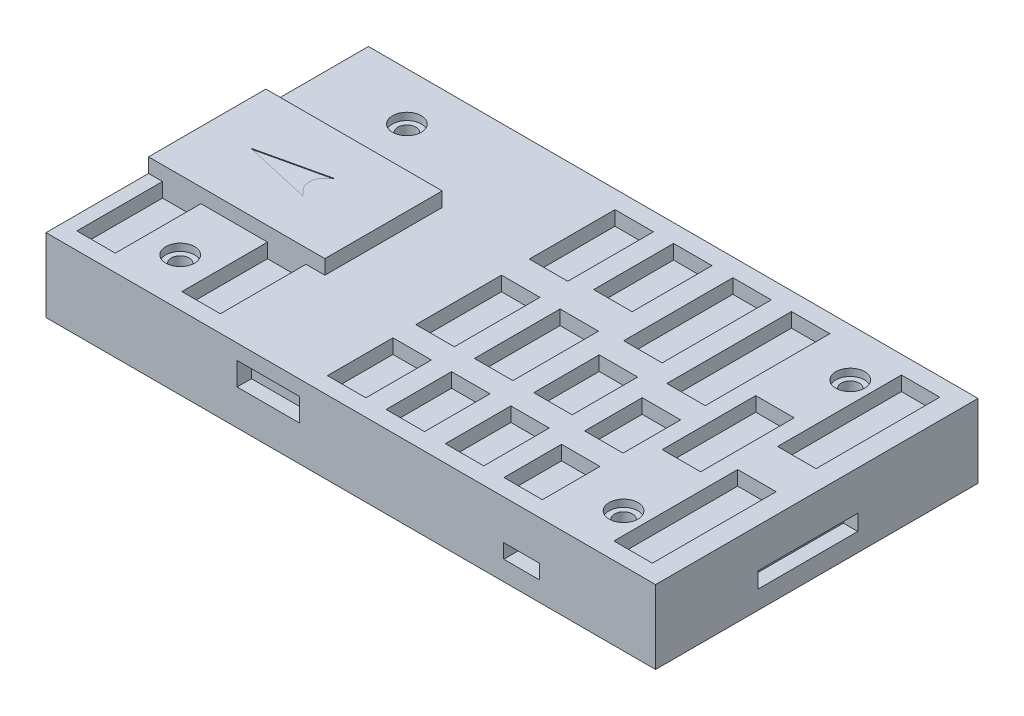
from build123d import *

# Parameters (mm, degrees)
SKETCH1_W           = 84.7
SKETCH1_H           = 44.8
BOSS_EXTRUDE1_DEPTH = 10.22
SKETCH2_W           = 24.5
SKETCH2_H           = 16.3
BOSS_EXTRUDE2_DEPTH = 2
SKETCH3_W           = 5.34
SKETCH3_H           = 9.1
SKETCH3_H_2         = 11.9
SKETCH3_H_3         = 11.1
SKETCH3_H_4         = 15.17
SKETCH3_H_5         = 17.32
SKETCH3_H_6         = 8
SKETCH3_H_7         = 13
SKETCH3_H_8         = 17.2
CUT_EXTRUDE1_DEPTH  = 2
SKETCH4_R           = 1.25
CUT_EXTRUDE2_DEPTH  = 50.443006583
SKETCH5_R           = 2
CUT_EXTRUDE3_DEPTH  = 1
SKETCH7_W           = 8.64
SKETCH7_H           = 3.2
CUT_EXTRUDE5_DEPTH  = 2
SKETCH8_W           = 5
SKETCH8_H           = 2
CUT_EXTRUDE6_DEPTH  = 2
SKETCH9_W           = 20.33
SKETCH9_H           = 3.1
SKETCH9_W_2         = 5.5
SKETCH9_H_2         = 2
CUT_EXTRUDE7_DEPTH  = 2
SKETCH10_W          = 13.9
SKETCH10_H          = 2.2
CUT_EXTRUDE8_DEPTH  = 2
CUT_EXTRUDE9_DEPTH  = 0.1
SCALE_1_SCALE       = 1.2


with BuildPart() as part:
    # Sketch1 → Boss-Extrude1 (new body)
    with BuildSketch(Plane(origin=(0, 0, 0), x_dir=(1, 0, 0), z_dir=(0, 1, 0))):
        Rectangle(SKETCH1_W, SKETCH1_H)
    extrude(amount=BOSS_EXTRUDE1_DEPTH)

    # Sketch2 → Boss-Extrude2 (add)
    with BuildSketch(Plane(origin=(0, 10.22, 0), x_dir=(1, 0, 0), z_dir=(0, 1, 0))):
        with Locations((-30.1, 0)):
            Rectangle(SKETCH2_W, SKETCH2_H)
    extrude(amount=BOSS_EXTRUDE2_DEPTH)

    # Sketch3 → Cut-Extrude1 (cut)
    with BuildSketch(Plane(origin=(0, 10.22, 0), x_dir=(1, 0, 0), z_dir=(0, 1, 0))):
        with Locations((-2.92, -15.5)):
            Rectangle(SKETCH3_W, SKETCH3_H)
        with Locations((-2.92, -1.82)):
            Rectangle(SKETCH3_W, SKETCH3_H_2)
        with Locations((-2.92, 13.95)):
            Rectangle(SKETCH3_W, SKETCH3_H_2)
        with Locations((5.22, 14.35)):
            Rectangle(SKETCH3_W, SKETCH3_H_3)
        with Locations((5.22, -1.82)):
            Rectangle(SKETCH3_W, SKETCH3_H_2)
        with Locations((5.22, -15.5)):
            Rectangle(SKETCH3_W, SKETCH3_H)
        with Locations((13.46, -15.5)):
            Rectangle(SKETCH3_W, SKETCH3_H)
        with Locations((13.46, -3.22)):
            Rectangle(SKETCH3_W, SKETCH3_H)
        with Locations((13.46, 12.315)):
            Rectangle(SKETCH3_W, SKETCH3_H_4)
        with Locations((21.6, 11.24)):
            Rectangle(SKETCH3_W, SKETCH3_H_5)
        with Locations((21.6, -4.84)):
            Rectangle(SKETCH3_W, SKETCH3_H_6)
        with Locations((21.6, -16.05)):
            Rectangle(SKETCH3_W, SKETCH3_H_6)
        with Locations((29.24, 0.8)):
            Rectangle(SKETCH3_W, SKETCH3_H_7)
        with Locations((36.88, 11.3)):
            Rectangle(SKETCH3_W, SKETCH3_H_8)
        with Locations((36.88, -11.45)):
            Rectangle(SKETCH3_W, SKETCH3_H_8)
        with Locations((-37.74, -14.1)):
            Rectangle(SKETCH3_W, SKETCH3_H_2)
        with Locations((-23.15, -14.1)):
            Rectangle(SKETCH3_W, SKETCH3_H_2)
    extrude(amount=-CUT_EXTRUDE1_DEPTH, mode=Mode.SUBTRACT)

    # Sketch4 → Cut-Extrude2 (cut, through all)
    with BuildSketch(Plane.XZ):
        with Locations(Location((-30.35, 15.75, 0), (0, 0, 270))):
            Circle(SKETCH4_R)
        with Locations(Location((-30.35, -15.75, 0), (0, 0, 270))):
            Circle(SKETCH4_R)
        with Locations(Location((31.25, 15.75, 0), (0, 0, 270))):
            Circle(SKETCH4_R)
        with Locations(Location((31.25, -15.75, 0), (0, 0, 270))):
            Circle(SKETCH4_R)
    extrude(amount=-CUT_EXTRUDE2_DEPTH, mode=Mode.SUBTRACT)

    # Sketch5 → Cut-Extrude3 (cut)
    with BuildSketch(Plane(origin=(0, 10.22, 0), x_dir=(1, 0, 0), z_dir=(0, 1, 0))):
        with Locations(Location((-30.35, -15.75, 0), (0, 0, 270))):
            Circle(SKETCH5_R)
        with Locations(Location((31.25, 15.75, 0), (0, 0, 270))):
            Circle(SKETCH5_R)
        with Locations(Location((31.25, -15.75, 0), (0, 0, 270))):
            Circle(SKETCH5_R)
        with Locations(Location((-30.35, 15.75, 0), (0, 0, 270))):
            Circle(SKETCH5_R)
    extrude(amount=-CUT_EXTRUDE3_DEPTH, mode=Mode.SUBTRACT)

    # Sketch7 → Cut-Extrude5 (cut)
    with BuildSketch(Plane.XY.offset(22.4)):
        with Locations((-11.48, 6.52)):
            Rectangle(SKETCH7_W, SKETCH7_H)
    extrude(amount=-CUT_EXTRUDE5_DEPTH, mode=Mode.SUBTRACT)

    # Sketch8 → Cut-Extrude6 (cut)
    with BuildSketch(Plane.XY.offset(22.4)):
        with Locations((23.75, 3.72)):
            Rectangle(SKETCH8_W, SKETCH8_H)
    extrude(amount=-CUT_EXTRUDE6_DEPTH, mode=Mode.SUBTRACT)

    # Sketch9 → Cut-Extrude7 (cut)
    with BuildSketch(Plane(origin=(0, 0, -22.4), x_dir=(-1, 0, 0), z_dir=(0, 0, -1))):
        with Locations((-2.885, 3.3)):
            Rectangle(SKETCH9_W, SKETCH9_H)
        with Locations((-23.2, 3.72)):
            Rectangle(SKETCH9_W_2, SKETCH9_H_2)
    extrude(amount=-CUT_EXTRUDE7_DEPTH, mode=Mode.SUBTRACT)

    # Sketch10 → Cut-Extrude8 (cut)
    with BuildSketch(Plane(origin=(42.35, 0, 0), x_dir=(0, 0, -1), z_dir=(1, 0, 0))):
        with Locations((-1.25, 3.66)):
            Rectangle(SKETCH10_W, SKETCH10_H)
    extrude(amount=-CUT_EXTRUDE8_DEPTH, mode=Mode.SUBTRACT)

    # Sketch11 → Cut-Extrude9 (cut)
    with BuildSketch(Plane(origin=(0, 12.22, 0), x_dir=(1, 0, 0), z_dir=(0, 1, 0))):
        with BuildLine():
            Line((-36.282417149, 0), (-26.882417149, 2.15))
            Line((-26.882417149, 2.15), (-27.617159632, 1.392199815))
            ThreePointArc((-27.617159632, 1.392199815), (-28.181269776, 0), (-27.617159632, -1.392199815))
            Line((-27.617159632, -1.392199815), (-26.882417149, -2.15))
            Line((-26.882417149, -2.15), (-36.282417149, 0))
        make_face()
    extrude(amount=-CUT_EXTRUDE9_DEPTH, mode=Mode.SUBTRACT)


with BuildPart() as part_1:
    # Scale 1: scaled about (0, 0, 0)
    add(part.part.scale(SCALE_1_SCALE))


solid = part_1.part
